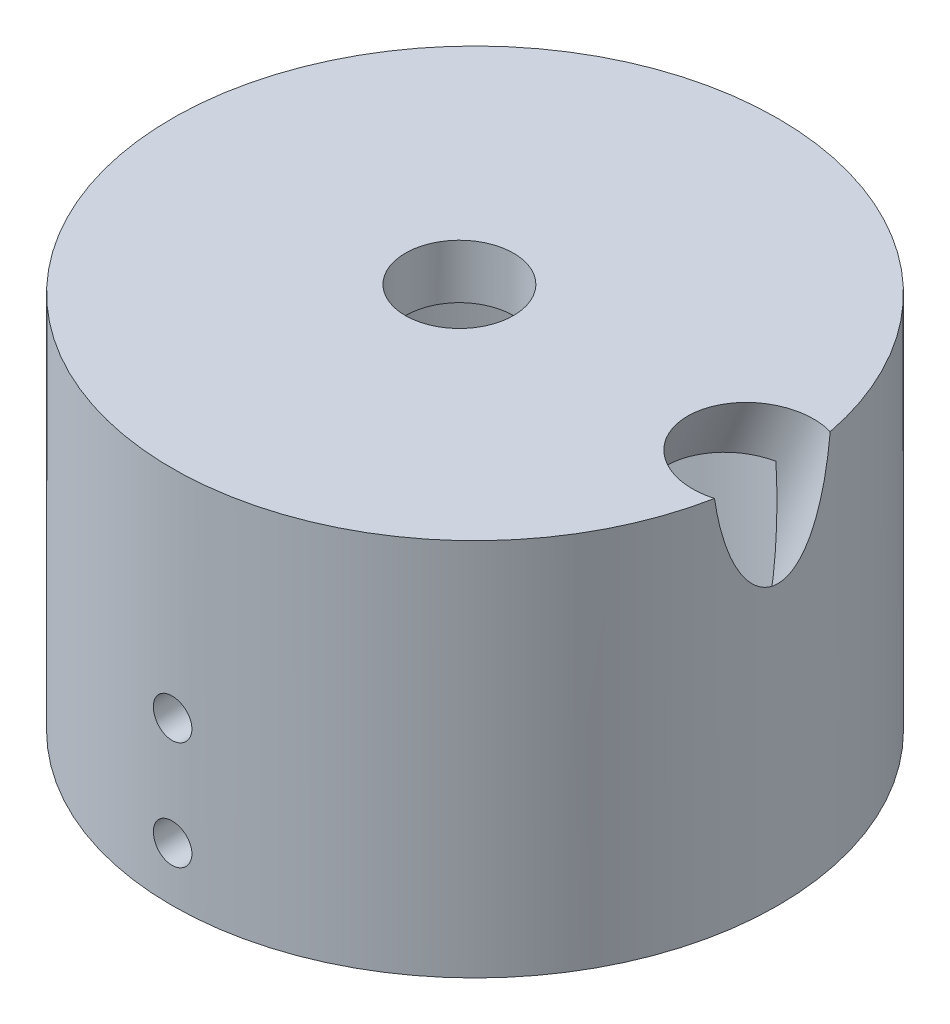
ISO-10303-21;
HEADER;
FILE_DESCRIPTION(('STEP AP214'),'2;1');
FILE_NAME('part.step','',(''),(''),'','','');
FILE_SCHEMA(('AUTOMOTIVE_DESIGN { 1 0 10303 214 1 1 1 1 }'));
ENDSEC;
DATA;
#1=APPLICATION_CONTEXT('core data for automotive mechanical design processes');
#2=APPLICATION_PROTOCOL_DEFINITION('international standard','automotive_design',2000,#1);
#3=PRODUCT_CONTEXT('',#1,'mechanical');
#4=PRODUCT('Part','Part','',(#3));
#5=PRODUCT_RELATED_PRODUCT_CATEGORY('part','',(#4));
#6=PRODUCT_DEFINITION_FORMATION('','',#4);
#7=PRODUCT_DEFINITION_CONTEXT('part definition',#1,'design');
#8=PRODUCT_DEFINITION('design','',#6,#7);
#9=PRODUCT_DEFINITION_SHAPE('','',#8);
#10=(LENGTH_UNIT() NAMED_UNIT(*) SI_UNIT(.MILLI.,.METRE.));
#11=(NAMED_UNIT(*) PLANE_ANGLE_UNIT() SI_UNIT($,.RADIAN.));
#12=(NAMED_UNIT(*) SI_UNIT($,.STERADIAN.) SOLID_ANGLE_UNIT());
#13=UNCERTAINTY_MEASURE_WITH_UNIT(LENGTH_MEASURE(1.E-05),#10,'distance_accuracy_value','');
#14=(GEOMETRIC_REPRESENTATION_CONTEXT(3) GLOBAL_UNCERTAINTY_ASSIGNED_CONTEXT((#13)) GLOBAL_UNIT_ASSIGNED_CONTEXT((#10,
#11,#12)) REPRESENTATION_CONTEXT('',''));
#15=CARTESIAN_POINT('',(0.,0.,0.));
#16=DIRECTION('',(0.,0.,1.));
#17=DIRECTION('',(1.,0.,0.));
#18=AXIS2_PLACEMENT_3D('',#15,#16,#17);
#19=CARTESIAN_POINT('',(0.,0.,0.));
#20=DIRECTION('',(0.,-1.,0.));
#21=DIRECTION('',(0.,0.,-1.));
#22=AXIS2_PLACEMENT_3D('',#19,#20,#21);
#23=CYLINDRICAL_SURFACE('',#22,14.605);
#24=CARTESIAN_POINT('',(-1.1303,3.175,14.5611966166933));
#25=CARTESIAN_POINT('',(-1.13029722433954,3.11161263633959,14.5611971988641));
#26=CARTESIAN_POINT('',(-1.12494991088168,3.04818173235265,14.5616149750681));
#27=CARTESIAN_POINT('',(-1.10369654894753,2.9230738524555,14.5632409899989));
#28=CARTESIAN_POINT('',(-1.0877784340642,2.86139896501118,14.5644501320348));
#29=CARTESIAN_POINT('',(-1.04584560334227,2.74163327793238,14.5675211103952));
#30=CARTESIAN_POINT('',(-1.01983648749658,2.68354051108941,14.5693825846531));
#31=CARTESIAN_POINT('',(-0.958469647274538,2.57255949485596,14.5735480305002));
#32=CARTESIAN_POINT('',(-0.92311396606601,2.51967011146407,14.5758519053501));
#33=CARTESIAN_POINT('',(-0.843972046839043,2.4204648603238,14.5806483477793));
#34=CARTESIAN_POINT('',(-0.800169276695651,2.37416219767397,14.5831412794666));
#35=CARTESIAN_POINT('',(-0.705411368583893,2.28955808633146,14.5880315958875));
#36=CARTESIAN_POINT('',(-0.654455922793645,2.2512569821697,14.5904289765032));
#37=CARTESIAN_POINT('',(-0.546761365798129,2.18370009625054,14.5948614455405));
#38=CARTESIAN_POINT('',(-0.4900151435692,2.15445561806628,14.5968960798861));
#39=CARTESIAN_POINT('',(-0.372399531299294,2.10591444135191,14.6003699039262));
#40=CARTESIAN_POINT('',(-0.311530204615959,2.08661759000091,14.6018091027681));
#41=CARTESIAN_POINT('',(-0.187526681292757,2.0585571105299,14.6039273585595));
#42=CARTESIAN_POINT('',(-0.124397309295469,2.04977227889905,14.604607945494));
#43=CARTESIAN_POINT('',(0.00244333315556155,2.04291968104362,14.605137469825));
#44=CARTESIAN_POINT('',(0.0661545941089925,2.04485174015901,14.6049864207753));
#45=CARTESIAN_POINT('',(0.192206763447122,2.05936069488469,14.6038709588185));
#46=CARTESIAN_POINT('',(0.254550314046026,2.07191478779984,14.6029082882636));
#47=CARTESIAN_POINT('',(0.376242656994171,2.1072760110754,14.6002798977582));
#48=CARTESIAN_POINT('',(0.435591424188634,2.1300832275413,14.5986141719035));
#49=CARTESIAN_POINT('',(0.549682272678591,2.18532882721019,14.5947641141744));
#50=CARTESIAN_POINT('',(0.604419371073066,2.21777746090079,14.592579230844));
#51=CARTESIAN_POINT('',(0.707678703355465,2.29137735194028,14.5879365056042));
#52=CARTESIAN_POINT('',(0.756200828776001,2.33252876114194,14.5854786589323));
#53=CARTESIAN_POINT('',(0.845786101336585,2.42249466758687,14.5805587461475));
#54=CARTESIAN_POINT('',(0.886829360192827,2.47132897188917,14.5780966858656));
#55=CARTESIAN_POINT('',(0.960138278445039,2.5752053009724,14.5734523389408));
#56=CARTESIAN_POINT('',(0.992403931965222,2.6302473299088,14.5712700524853));
#57=CARTESIAN_POINT('',(1.04724077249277,2.74499021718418,14.5674318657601));
#58=CARTESIAN_POINT('',(1.06981098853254,2.80469154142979,14.5657760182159));
#59=CARTESIAN_POINT('',(1.10460185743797,2.92705192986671,14.5631791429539));
#60=CARTESIAN_POINT('',(1.11682269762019,2.98971094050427,14.5622381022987));
#61=CARTESIAN_POINT('',(1.13054285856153,3.11603418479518,14.5611794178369));
#62=CARTESIAN_POINT('',(1.13206988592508,3.17969539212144,14.5610596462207));
#63=CARTESIAN_POINT('',(1.12443159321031,3.30636869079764,14.5616514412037));
#64=CARTESIAN_POINT('',(1.11526635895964,3.36938078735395,14.5623630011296));
#65=CARTESIAN_POINT('',(1.08652678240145,3.49288801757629,14.5645353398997));
#66=CARTESIAN_POINT('',(1.06696531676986,3.55338616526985,14.565995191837));
#67=CARTESIAN_POINT('',(1.01800163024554,3.67024143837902,14.5694988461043));
#68=CARTESIAN_POINT('',(0.988599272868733,3.72659850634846,14.5715426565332));
#69=CARTESIAN_POINT('',(0.920718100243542,3.83369879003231,14.5759890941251));
#70=CARTESIAN_POINT('',(0.882220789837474,3.88443025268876,14.5783924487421));
#71=CARTESIAN_POINT('',(0.797269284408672,3.97872058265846,14.5832846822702));
#72=CARTESIAN_POINT('',(0.750814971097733,4.02227934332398,14.5857735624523));
#73=CARTESIAN_POINT('',(0.651148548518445,4.10108206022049,14.5905627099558));
#74=CARTESIAN_POINT('',(0.597922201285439,4.13630803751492,14.592862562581));
#75=CARTESIAN_POINT('',(0.486293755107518,4.1973219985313,14.5970085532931));
#76=CARTESIAN_POINT('',(0.427891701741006,4.22311006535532,14.5988546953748));
#77=CARTESIAN_POINT('',(0.307634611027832,4.26448517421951,14.601883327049));
#78=CARTESIAN_POINT('',(0.245783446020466,4.28008341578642,14.6030665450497));
#79=CARTESIAN_POINT('',(0.120330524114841,4.30067271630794,14.6046389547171));
#80=CARTESIAN_POINT('',(0.0567287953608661,4.30566394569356,14.6050281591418));
#81=CARTESIAN_POINT('',(-0.070242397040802,4.30489566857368,14.6049687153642));
#82=CARTESIAN_POINT('',(-0.133612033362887,4.29916421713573,14.6045222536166));
#83=CARTESIAN_POINT('',(-0.258485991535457,4.2771716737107,14.6028459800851));
#84=CARTESIAN_POINT('',(-0.319990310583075,4.26091056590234,14.6016161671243));
#85=CARTESIAN_POINT('',(-0.439390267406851,4.21832720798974,14.5985112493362));
#86=CARTESIAN_POINT('',(-0.497286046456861,4.19200535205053,14.5966361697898));
#87=CARTESIAN_POINT('',(-0.607841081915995,4.13005103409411,14.592450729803));
#88=CARTESIAN_POINT('',(-0.660500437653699,4.09441874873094,14.5901403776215));
#89=CARTESIAN_POINT('',(-0.759231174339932,4.01474995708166,14.5853366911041));
#90=CARTESIAN_POINT('',(-0.805285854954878,3.97069278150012,14.5828429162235));
#91=CARTESIAN_POINT('',(-0.889364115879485,3.87546023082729,14.5779571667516));
#92=CARTESIAN_POINT('',(-0.927385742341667,3.82428312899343,14.5755652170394));
#93=CARTESIAN_POINT('',(-0.994362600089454,3.71617715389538,14.5711495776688));
#94=CARTESIAN_POINT('',(-1.02330257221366,3.65923881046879,14.5691265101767));
#95=CARTESIAN_POINT('',(-1.07117500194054,3.54133515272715,14.5656853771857));
#96=CARTESIAN_POINT('',(-1.09011903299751,3.48037458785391,14.5642666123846));
#97=CARTESIAN_POINT('',(-1.11260579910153,3.37837507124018,14.5625617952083));
#98=CARTESIAN_POINT('',(-1.11923238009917,3.3379932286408,14.5620521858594));
#99=CARTESIAN_POINT('',(-1.12808037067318,3.2567469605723,14.5613694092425));
#100=CARTESIAN_POINT('',(-1.1303017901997,3.21588253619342,14.5611962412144));
#101=CARTESIAN_POINT('',(-1.1303,3.175,14.5611966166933));
#102=B_SPLINE_CURVE_WITH_KNOTS('',3,(#24,#25,#26,#27,#28,#29,#30,#31,#32,#33,#34,#35,#36,#37,
#38,#39,#40,#41,#42,#43,#44,#45,#46,#47,#48,#49,#50,#51,#52,#53,#54,#55,#56,#57,#58,#59,#60,#61,
#62,#63,#64,#65,#66,#67,#68,#69,#70,#71,#72,#73,#74,#75,#76,#77,#78,#79,#80,#81,#82,#83,#84,#85,
#86,#87,#88,#89,#90,#91,#92,#93,#94,#95,#96,#97,#98,#99,#100,#101),.UNSPECIFIED.,.T.,.F.,(4,2,2,
2,2,2,2,2,2,2,2,2,2,2,2,2,2,2,2,2,2,2,2,2,2,2,2,2,2,2,2,2,2,2,2,2,2,2,4),(0.,0.190012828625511,
0.380242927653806,0.570367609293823,0.760450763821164,0.950909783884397,1.14137700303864,
1.33208099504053,1.522782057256,1.71309780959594,1.90341046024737,2.0933155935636,
2.28322232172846,2.47333168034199,2.66344435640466,2.85405544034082,3.044666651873,
3.23529694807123,3.42592379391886,3.61605656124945,3.80618780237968,3.99608409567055,
4.18598302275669,4.37627149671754,4.56656279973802,4.75726100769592,4.94795753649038,
5.13844411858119,5.32892763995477,5.5189134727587,5.70889959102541,5.89887826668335,
6.08885333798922,6.2793006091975,6.46979414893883,6.6606060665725,6.85119657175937,
6.97374818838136,7.09629952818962),.UNSPECIFIED.);
#103=CARTESIAN_POINT('',(-1.1303,3.175,14.5611966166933));
#104=VERTEX_POINT('',#103);
#105=EDGE_CURVE('E73',#104,#104,#102,.T.);
#106=ORIENTED_EDGE('',*,*,#105,.T.);
#107=EDGE_LOOP('',(#106));
#108=FACE_BOUND('',#107,.T.);
#109=CARTESIAN_POINT('',(0.,0.,0.));
#110=DIRECTION('',(0.,-1.,0.));
#111=DIRECTION('',(0.,0.,-1.));
#112=AXIS2_PLACEMENT_3D('',#109,#110,#111);
#113=CIRCLE('',#112,14.605);
#114=CARTESIAN_POINT('',(0.,0.,-14.605));
#115=VERTEX_POINT('',#114);
#116=EDGE_CURVE('E80',#115,#115,#113,.T.);
#117=ORIENTED_EDGE('',*,*,#116,.T.);
#118=EDGE_LOOP('',(#117));
#119=FACE_BOUND('',#118,.T.);
#120=CARTESIAN_POINT('',(0.,19.05,0.));
#121=DIRECTION('',(0.,-1.,0.));
#122=DIRECTION('',(0.,0.,-1.));
#123=AXIS2_PLACEMENT_3D('',#120,#121,#122);
#124=CIRCLE('',#123,14.605);
#125=CARTESIAN_POINT('',(14.1869840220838,19.05,3.46922316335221));
#126=VERTEX_POINT('',#125);
#127=CARTESIAN_POINT('',(14.1869840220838,19.05,-3.46922316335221));
#128=VERTEX_POINT('',#127);
#129=EDGE_CURVE('E66',#126,#128,#124,.T.);
#130=ORIENTED_EDGE('',*,*,#129,.F.);
#131=CARTESIAN_POINT('',(14.1869840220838,19.05,3.46922316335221));
#132=CARTESIAN_POINT('',(14.1812130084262,18.7557643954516,3.49278086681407));
#133=CARTESIAN_POINT('',(14.1765358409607,18.4611225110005,3.51169291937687));
#134=CARTESIAN_POINT('',(14.1695344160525,17.8712678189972,3.53986017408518));
#135=CARTESIAN_POINT('',(14.1672108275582,17.5760548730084,3.54911263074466));
#136=CARTESIAN_POINT('',(14.1650750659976,16.9826385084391,3.55762189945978));
#137=CARTESIAN_POINT('',(14.1652871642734,16.68443353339,3.55678210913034));
#138=CARTESIAN_POINT('',(14.1684555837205,16.0882909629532,3.5441419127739));
#139=CARTESIAN_POINT('',(14.1714116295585,15.7903533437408,3.5323426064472));
#140=CARTESIAN_POINT('',(14.1803795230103,15.1857712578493,3.49617355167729));
#141=CARTESIAN_POINT('',(14.1864853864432,14.8791505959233,3.47141669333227));
#142=CARTESIAN_POINT('',(14.2019738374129,14.2675188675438,3.40749913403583));
#143=CARTESIAN_POINT('',(14.21135596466,13.9625075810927,3.3683404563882));
#144=CARTESIAN_POINT('',(14.2334984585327,13.3562698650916,3.27352347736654));
#145=CARTESIAN_POINT('',(14.2462460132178,13.0550335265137,3.21792765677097));
#146=CARTESIAN_POINT('',(14.2679458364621,12.6066486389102,3.11974952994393));
#147=CARTESIAN_POINT('',(14.275606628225,12.4578019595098,3.08457003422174));
#148=CARTESIAN_POINT('',(14.2917799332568,12.1615578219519,3.0087480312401));
#149=CARTESIAN_POINT('',(14.3002923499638,12.0141602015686,2.96810614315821));
#150=CARTESIAN_POINT('',(14.3175143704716,11.7316161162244,2.88383788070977));
#151=CARTESIAN_POINT('',(14.3261671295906,11.5963424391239,2.84062786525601));
#152=CARTESIAN_POINT('',(14.3441573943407,11.3278144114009,2.7483426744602));
#153=CARTESIAN_POINT('',(14.3534950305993,11.1945604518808,2.69926637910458));
#154=CARTESIAN_POINT('',(14.37278427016,10.9308552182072,2.594595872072));
#155=CARTESIAN_POINT('',(14.3827351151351,10.8004007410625,2.53900963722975));
#156=CARTESIAN_POINT('',(14.403168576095,10.5429526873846,2.42041056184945));
#157=CARTESIAN_POINT('',(14.4136510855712,10.41595842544,2.35739920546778));
#158=CARTESIAN_POINT('',(14.4329924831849,10.1900606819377,2.23557610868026));
#159=CARTESIAN_POINT('',(14.441785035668,10.0903738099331,2.178211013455));
#160=CARTESIAN_POINT('',(14.4595113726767,9.89487607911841,2.05725424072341));
#161=CARTESIAN_POINT('',(14.4684451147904,9.79906408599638,1.99366440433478));
#162=CARTESIAN_POINT('',(14.4862788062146,9.61261145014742,1.85965399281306));
#163=CARTESIAN_POINT('',(14.4951787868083,9.52196005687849,1.78924850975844));
#164=CARTESIAN_POINT('',(14.5127352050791,9.3472051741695,1.64076983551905));
#165=CARTESIAN_POINT('',(14.5213918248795,9.26309670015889,1.56270258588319));
#166=CARTESIAN_POINT('',(14.5390532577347,9.09493934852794,1.38936627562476));
#167=CARTESIAN_POINT('',(14.54799756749,9.01184358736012,1.29315092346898));
#168=CARTESIAN_POINT('',(14.5646398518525,8.8600219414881,1.08979736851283));
#169=CARTESIAN_POINT('',(14.5723390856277,8.79128151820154,0.982670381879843));
#170=CARTESIAN_POINT('',(14.58466563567,8.6826478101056,0.776168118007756));
#171=CARTESIAN_POINT('',(14.5895883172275,8.63988789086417,0.678337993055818));
#172=CARTESIAN_POINT('',(14.5975597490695,8.57111011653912,0.476862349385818));
#173=CARTESIAN_POINT('',(14.6006103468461,8.54507575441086,0.373222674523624));
#174=CARTESIAN_POINT('',(14.6044824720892,8.51208874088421,0.162177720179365));
#175=CARTESIAN_POINT('',(14.6052901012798,8.50525506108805,0.0547531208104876));
#176=CARTESIAN_POINT('',(14.6045221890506,8.51177500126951,-0.159471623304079));
#177=CARTESIAN_POINT('',(14.6029464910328,8.52512994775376,-0.266271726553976));
#178=CARTESIAN_POINT('',(14.5978826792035,8.56840724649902,-0.465689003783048));
#179=CARTESIAN_POINT('',(14.5945901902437,8.59663754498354,-0.558690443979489));
#180=CARTESIAN_POINT('',(14.5865485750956,8.66631902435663,-0.739477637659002));
#181=CARTESIAN_POINT('',(14.5817988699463,8.7077754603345,-0.827261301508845));
#182=CARTESIAN_POINT('',(14.5683208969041,8.82701096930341,-1.04269957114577));
#183=CARTESIAN_POINT('',(14.5588322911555,8.91229297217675,-1.16614113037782));
#184=CARTESIAN_POINT('',(14.5383938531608,9.10101824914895,-1.39813872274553));
#185=CARTESIAN_POINT('',(14.5274400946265,9.20451056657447,-1.50665311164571));
#186=CARTESIAN_POINT('',(14.5066885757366,9.40668805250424,-1.69393169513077));
#187=CARTESIAN_POINT('',(14.4969798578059,9.50357047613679,-1.77469088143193));
#188=CARTESIAN_POINT('',(14.4774497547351,9.703992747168,-1.9275420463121));
#189=CARTESIAN_POINT('',(14.4676282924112,9.80753741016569,-1.99962764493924));
#190=CARTESIAN_POINT('',(14.4481005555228,10.0197220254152,-2.13615827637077));
#191=CARTESIAN_POINT('',(14.4383944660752,10.1283690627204,-2.20059221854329));
#192=CARTESIAN_POINT('',(14.419267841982,10.3494924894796,-2.32261749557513));
#193=CARTESIAN_POINT('',(14.4098474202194,10.4619703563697,-2.38020615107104));
#194=CARTESIAN_POINT('',(14.3912799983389,10.6914149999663,-2.49002587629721));
#195=CARTESIAN_POINT('',(14.3821384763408,10.8084220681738,-2.54217320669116));
#196=CARTESIAN_POINT('',(14.3643404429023,11.0448161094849,-2.64088088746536));
#197=CARTESIAN_POINT('',(14.3556840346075,11.1642035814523,-2.68744005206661));
#198=CARTESIAN_POINT('',(14.3305125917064,11.5253373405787,-2.81967505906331));
#199=CARTESIAN_POINT('',(14.3148075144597,11.7699050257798,-2.89783887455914));
#200=CARTESIAN_POINT('',(14.2857016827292,12.2650225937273,-3.03806654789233));
#201=CARTESIAN_POINT('',(14.2723135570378,12.5155972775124,-3.10004305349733));
#202=CARTESIAN_POINT('',(14.2479923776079,13.0197863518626,-3.20996878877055));
#203=CARTESIAN_POINT('',(14.2370583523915,13.2733994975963,-3.25792357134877));
#204=CARTESIAN_POINT('',(14.2185282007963,13.7585908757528,-3.33781096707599));
#205=CARTESIAN_POINT('',(14.2107142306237,13.9899854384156,-3.37082973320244));
#206=CARTESIAN_POINT('',(14.1970128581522,14.4539350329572,-3.42807765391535));
#207=CARTESIAN_POINT('',(14.1911256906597,14.6864902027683,-3.45230573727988));
#208=CARTESIAN_POINT('',(14.1812045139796,15.1525387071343,-3.4928349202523));
#209=CARTESIAN_POINT('',(14.1771722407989,15.3860327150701,-3.50912859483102));
#210=CARTESIAN_POINT('',(14.1708896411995,15.8534413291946,-3.53441366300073));
#211=CARTESIAN_POINT('',(14.1686393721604,16.0873559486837,-3.54340482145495));
#212=CARTESIAN_POINT('',(14.1658750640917,16.5491554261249,-3.55443934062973));
#213=CARTESIAN_POINT('',(14.1653166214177,16.777035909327,-3.55666039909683));
#214=CARTESIAN_POINT('',(14.1657323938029,17.232775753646,-3.55500337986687));
#215=CARTESIAN_POINT('',(14.1667066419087,17.4606351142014,-3.5511251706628));
#216=CARTESIAN_POINT('',(14.170106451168,17.9156270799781,-3.53753645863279));
#217=CARTESIAN_POINT('',(14.1725285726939,18.1427601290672,-3.52783977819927));
#218=CARTESIAN_POINT('',(14.1787456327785,18.5966750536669,-3.50276126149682));
#219=CARTESIAN_POINT('',(14.1825404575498,18.8234569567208,-3.48737989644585));
#220=CARTESIAN_POINT('',(14.1869840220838,19.05,-3.46922316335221));
#221=B_SPLINE_CURVE_WITH_KNOTS('',3,(#131,#132,#133,#134,#135,#136,#137,#138,#139,#140,#141,
#142,#143,#144,#145,#146,#147,#148,#149,#150,#151,#152,#153,#154,#155,#156,#157,#158,#159,#160,
#161,#162,#163,#164,#165,#166,#167,#168,#169,#170,#171,#172,#173,#174,#175,#176,#177,#178,#179,
#180,#181,#182,#183,#184,#185,#186,#187,#188,#189,#190,#191,#192,#193,#194,#195,#196,#197,#198,
#199,#200,#201,#202,#203,#204,#205,#206,#207,#208,#209,#210,#211,#212,#213,#214,#215,#216,#217,
#218,#219,#220),.UNSPECIFIED.,.F.,.F.,(4,2,2,2,2,2,2,2,2,2,2,2,2,2,2,2,2,2,2,2,2,2,2,2,2,2,2,2,
2,2,2,2,2,2,2,2,2,2,2,2,2,2,2,2,4),(0.,0.885680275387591,1.77161221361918,2.66603094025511,
3.56035992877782,4.48307575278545,5.40566199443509,6.32478543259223,6.78411815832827,
7.24339886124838,7.67009242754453,8.09686759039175,8.52312517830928,8.94929770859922,
9.29515115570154,9.64090261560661,9.98590525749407,10.330642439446,10.7119555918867,
11.0928806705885,11.4122446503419,11.7312929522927,12.0523138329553,12.3733558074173,
12.663938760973,12.9546373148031,13.4030805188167,13.8527504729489,14.2317170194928,
14.6109606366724,14.9907474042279,15.3706823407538,15.755796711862,16.1409926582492,
16.9118800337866,17.6868452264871,18.4615030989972,19.1629217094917,19.8644257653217,
20.5665850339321,21.2687669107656,21.9523523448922,22.6359525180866,23.3179351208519,
23.9998612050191),.UNSPECIFIED.);
#222=EDGE_CURVE('E72',#126,#128,#221,.T.);
#223=ORIENTED_EDGE('',*,*,#222,.T.);
#224=EDGE_LOOP('',(#130,#223));
#225=FACE_BOUND('',#224,.T.);
#226=CARTESIAN_POINT('',(-1.1303,9.525,14.5611966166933));
#227=CARTESIAN_POINT('',(-1.13029722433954,9.46161263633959,14.5611971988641));
#228=CARTESIAN_POINT('',(-1.12494991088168,9.39818173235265,14.5616149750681));
#229=CARTESIAN_POINT('',(-1.10369654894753,9.27307385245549,14.5632409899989));
#230=CARTESIAN_POINT('',(-1.0877784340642,9.21139896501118,14.5644501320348));
#231=CARTESIAN_POINT('',(-1.04584560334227,9.09163327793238,14.5675211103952));
#232=CARTESIAN_POINT('',(-1.01983648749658,9.0335405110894,14.5693825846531));
#233=CARTESIAN_POINT('',(-0.958469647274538,8.92255949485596,14.5735480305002));
#234=CARTESIAN_POINT('',(-0.92311396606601,8.86967011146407,14.5758519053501));
#235=CARTESIAN_POINT('',(-0.843972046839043,8.77046486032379,14.5806483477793));
#236=CARTESIAN_POINT('',(-0.80016927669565,8.72416219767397,14.5831412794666));
#237=CARTESIAN_POINT('',(-0.705411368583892,8.63955808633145,14.5880315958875));
#238=CARTESIAN_POINT('',(-0.654455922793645,8.6012569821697,14.5904289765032));
#239=CARTESIAN_POINT('',(-0.546761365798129,8.53370009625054,14.5948614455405));
#240=CARTESIAN_POINT('',(-0.490015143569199,8.50445561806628,14.5968960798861));
#241=CARTESIAN_POINT('',(-0.372399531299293,8.45591444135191,14.6003699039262));
#242=CARTESIAN_POINT('',(-0.311530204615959,8.43661759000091,14.6018091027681));
#243=CARTESIAN_POINT('',(-0.187526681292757,8.4085571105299,14.6039273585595));
#244=CARTESIAN_POINT('',(-0.124397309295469,8.39977227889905,14.604607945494));
#245=CARTESIAN_POINT('',(0.00244333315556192,8.39291968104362,14.605137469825));
#246=CARTESIAN_POINT('',(0.0661545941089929,8.39485174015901,14.6049864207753));
#247=CARTESIAN_POINT('',(0.192206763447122,8.40936069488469,14.6038709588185));
#248=CARTESIAN_POINT('',(0.254550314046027,8.42191478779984,14.6029082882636));
#249=CARTESIAN_POINT('',(0.376242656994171,8.4572760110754,14.6002798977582));
#250=CARTESIAN_POINT('',(0.435591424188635,8.4800832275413,14.5986141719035));
#251=CARTESIAN_POINT('',(0.549682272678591,8.53532882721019,14.5947641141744));
#252=CARTESIAN_POINT('',(0.604419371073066,8.56777746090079,14.592579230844));
#253=CARTESIAN_POINT('',(0.707678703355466,8.64137735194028,14.5879365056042));
#254=CARTESIAN_POINT('',(0.756200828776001,8.68252876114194,14.5854786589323));
#255=CARTESIAN_POINT('',(0.845786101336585,8.77249466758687,14.5805587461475));
#256=CARTESIAN_POINT('',(0.886829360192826,8.82132897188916,14.5780966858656));
#257=CARTESIAN_POINT('',(0.960138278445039,8.9252053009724,14.5734523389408));
#258=CARTESIAN_POINT('',(0.992403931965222,8.9802473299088,14.5712700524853));
#259=CARTESIAN_POINT('',(1.04724077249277,9.09499021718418,14.5674318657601));
#260=CARTESIAN_POINT('',(1.06981098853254,9.15469154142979,14.5657760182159));
#261=CARTESIAN_POINT('',(1.10460185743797,9.27705192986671,14.5631791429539));
#262=CARTESIAN_POINT('',(1.11682269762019,9.33971094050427,14.5622381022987));
#263=CARTESIAN_POINT('',(1.13054285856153,9.46603418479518,14.5611794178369));
#264=CARTESIAN_POINT('',(1.13206988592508,9.52969539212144,14.5610596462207));
#265=CARTESIAN_POINT('',(1.12443159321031,9.65636869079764,14.5616514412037));
#266=CARTESIAN_POINT('',(1.11526635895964,9.71938078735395,14.5623630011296));
#267=CARTESIAN_POINT('',(1.08652678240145,9.84288801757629,14.5645353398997));
#268=CARTESIAN_POINT('',(1.06696531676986,9.90338616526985,14.565995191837));
#269=CARTESIAN_POINT('',(1.01800163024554,10.020241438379,14.5694988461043));
#270=CARTESIAN_POINT('',(0.988599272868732,10.0765985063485,14.5715426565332));
#271=CARTESIAN_POINT('',(0.920718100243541,10.1836987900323,14.5759890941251));
#272=CARTESIAN_POINT('',(0.882220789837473,10.2344302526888,14.5783924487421));
#273=CARTESIAN_POINT('',(0.79726928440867,10.3287205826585,14.5832846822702));
#274=CARTESIAN_POINT('',(0.750814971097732,10.372279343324,14.5857735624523));
#275=CARTESIAN_POINT('',(0.651148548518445,10.4510820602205,14.5905627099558));
#276=CARTESIAN_POINT('',(0.597922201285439,10.4863080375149,14.592862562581));
#277=CARTESIAN_POINT('',(0.486293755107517,10.5473219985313,14.5970085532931));
#278=CARTESIAN_POINT('',(0.427891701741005,10.5731100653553,14.5988546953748));
#279=CARTESIAN_POINT('',(0.307634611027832,10.6144851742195,14.601883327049));
#280=CARTESIAN_POINT('',(0.245783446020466,10.6300834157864,14.6030665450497));
#281=CARTESIAN_POINT('',(0.120330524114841,10.6506727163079,14.6046389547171));
#282=CARTESIAN_POINT('',(0.0567287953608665,10.6556639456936,14.6050281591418));
#283=CARTESIAN_POINT('',(-0.0702423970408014,10.6548956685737,14.6049687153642));
#284=CARTESIAN_POINT('',(-0.133612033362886,10.6491642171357,14.6045222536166));
#285=CARTESIAN_POINT('',(-0.258485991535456,10.6271716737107,14.6028459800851));
#286=CARTESIAN_POINT('',(-0.319990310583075,10.6109105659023,14.6016161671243));
#287=CARTESIAN_POINT('',(-0.439390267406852,10.5683272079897,14.5985112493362));
#288=CARTESIAN_POINT('',(-0.497286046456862,10.5420053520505,14.5966361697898));
#289=CARTESIAN_POINT('',(-0.607841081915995,10.4800510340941,14.592450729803));
#290=CARTESIAN_POINT('',(-0.6605004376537,10.4444187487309,14.5901403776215));
#291=CARTESIAN_POINT('',(-0.759231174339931,10.3647499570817,14.5853366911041));
#292=CARTESIAN_POINT('',(-0.805285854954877,10.3206927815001,14.5828429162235));
#293=CARTESIAN_POINT('',(-0.889364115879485,10.2254602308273,14.5779571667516));
#294=CARTESIAN_POINT('',(-0.927385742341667,10.1742831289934,14.5755652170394));
#295=CARTESIAN_POINT('',(-0.994362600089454,10.0661771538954,14.5711495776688));
#296=CARTESIAN_POINT('',(-1.02330257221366,10.0092388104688,14.5691265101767));
#297=CARTESIAN_POINT('',(-1.07117500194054,9.89133515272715,14.5656853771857));
#298=CARTESIAN_POINT('',(-1.09011903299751,9.83037458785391,14.5642666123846));
#299=CARTESIAN_POINT('',(-1.11260579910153,9.72837507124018,14.5625617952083));
#300=CARTESIAN_POINT('',(-1.11923238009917,9.6879932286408,14.5620521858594));
#301=CARTESIAN_POINT('',(-1.12808037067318,9.6067469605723,14.5613694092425));
#302=CARTESIAN_POINT('',(-1.1303017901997,9.56588253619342,14.5611962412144));
#303=CARTESIAN_POINT('',(-1.1303,9.525,14.5611966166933));
#304=B_SPLINE_CURVE_WITH_KNOTS('',3,(#226,#227,#228,#229,#230,#231,#232,#233,#234,#235,#236,
#237,#238,#239,#240,#241,#242,#243,#244,#245,#246,#247,#248,#249,#250,#251,#252,#253,#254,#255,
#256,#257,#258,#259,#260,#261,#262,#263,#264,#265,#266,#267,#268,#269,#270,#271,#272,#273,#274,
#275,#276,#277,#278,#279,#280,#281,#282,#283,#284,#285,#286,#287,#288,#289,#290,#291,#292,#293,
#294,#295,#296,#297,#298,#299,#300,#301,#302,#303),.UNSPECIFIED.,.T.,.F.,(4,2,2,2,2,2,2,2,2,2,2,
2,2,2,2,2,2,2,2,2,2,2,2,2,2,2,2,2,2,2,2,2,2,2,2,2,2,2,4),(0.,0.190012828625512,
0.380242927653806,0.570367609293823,0.760450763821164,0.950909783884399,1.14137700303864,
1.33208099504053,1.522782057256,1.71309780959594,1.90341046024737,2.0933155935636,
2.28322232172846,2.47333168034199,2.66344435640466,2.85405544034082,3.044666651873,
3.23529694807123,3.42592379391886,3.61605656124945,3.80618780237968,3.99608409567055,
4.18598302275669,4.37627149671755,4.56656279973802,4.75726100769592,4.94795753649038,
5.13844411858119,5.32892763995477,5.5189134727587,5.7088995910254,5.89887826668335,
6.08885333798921,6.27930060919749,6.46979414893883,6.66060606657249,6.85119657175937,
6.97374818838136,7.09629952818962),.UNSPECIFIED.);
#305=CARTESIAN_POINT('',(-1.1303,9.525,14.5611966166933));
#306=VERTEX_POINT('',#305);
#307=EDGE_CURVE('E112',#306,#306,#304,.T.);
#308=ORIENTED_EDGE('',*,*,#307,.T.);
#309=EDGE_LOOP('',(#308));
#310=FACE_BOUND('',#309,.T.);
#311=ADVANCED_FACE('F31',(#108,#119,#225,#310),#23,.F.);
#312=CARTESIAN_POINT('',(0.,0.,0.));
#313=DIRECTION('',(0.,-1.,0.));
#314=DIRECTION('',(0.,0.,-1.));
#315=AXIS2_PLACEMENT_3D('',#312,#313,#314);
#316=CYLINDRICAL_SURFACE('',#315,17.78);
#317=CARTESIAN_POINT('',(0.,0.,0.));
#318=DIRECTION('',(0.,-1.,0.));
#319=DIRECTION('',(0.,0.,-1.));
#320=AXIS2_PLACEMENT_3D('',#317,#318,#319);
#321=CIRCLE('',#320,17.78);
#322=CARTESIAN_POINT('',(0.,0.,-17.78));
#323=VERTEX_POINT('',#322);
#324=EDGE_CURVE('E76',#323,#323,#321,.T.);
#325=ORIENTED_EDGE('',*,*,#324,.F.);
#326=EDGE_LOOP('',(#325));
#327=FACE_BOUND('',#326,.T.);
#328=CARTESIAN_POINT('',(0.,22.225,0.));
#329=DIRECTION('',(0.,-1.,0.));
#330=DIRECTION('',(0.,0.,-1.));
#331=AXIS2_PLACEMENT_3D('',#328,#329,#330);
#332=CIRCLE('',#331,17.78);
#333=CARTESIAN_POINT('',(17.4528632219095,22.225,3.3949912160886));
#334=VERTEX_POINT('',#333);
#335=CARTESIAN_POINT('',(17.4528632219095,22.225,-3.3949912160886));
#336=VERTEX_POINT('',#335);
#337=EDGE_CURVE('E71',#334,#336,#332,.T.);
#338=ORIENTED_EDGE('',*,*,#337,.T.);
#339=CARTESIAN_POINT('',(17.4528632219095,22.225,-3.3949912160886));
#340=CARTESIAN_POINT('',(17.4563597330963,22.0796539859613,-3.37700677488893));
#341=CARTESIAN_POINT('',(17.4601539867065,21.9345132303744,-3.35736221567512));
#342=CARTESIAN_POINT('',(17.4683441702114,21.6447531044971,-3.3144903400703));
#343=CARTESIAN_POINT('',(17.4727402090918,21.5001338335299,-3.29126237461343));
#344=CARTESIAN_POINT('',(17.4821587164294,21.210971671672,-3.24086140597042));
#345=CARTESIAN_POINT('',(17.4871837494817,21.0664316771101,-3.21367217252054));
#346=CARTESIAN_POINT('',(17.4978462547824,20.7782308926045,-3.1551013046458));
#347=CARTESIAN_POINT('',(17.5034836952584,20.6345700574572,-3.12371988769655));
#348=CARTESIAN_POINT('',(17.5155943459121,20.3428736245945,-3.05509674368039));
#349=CARTESIAN_POINT('',(17.5220912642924,20.1948806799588,-3.01767687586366));
#350=CARTESIAN_POINT('',(17.5357277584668,19.9004090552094,-2.93739872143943));
#351=CARTESIAN_POINT('',(17.5428672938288,19.7539302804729,-2.8945407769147));
#352=CARTESIAN_POINT('',(17.5577518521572,19.4631433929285,-2.80283893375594));
#353=CARTESIAN_POINT('',(17.5654958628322,19.3188321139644,-2.75400496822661));
#354=CARTESIAN_POINT('',(17.5815549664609,19.0327386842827,-2.64955108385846));
#355=CARTESIAN_POINT('',(17.5898699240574,18.890955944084,-2.59393277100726));
#356=CARTESIAN_POINT('',(17.6064128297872,18.6203308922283,-2.47906411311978));
#357=CARTESIAN_POINT('',(17.6146073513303,18.4912697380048,-2.42032749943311));
#358=CARTESIAN_POINT('',(17.6313487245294,18.2368431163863,-2.29519795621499));
#359=CARTESIAN_POINT('',(17.6398957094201,18.1114790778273,-2.22880211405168));
#360=CARTESIAN_POINT('',(17.6571358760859,17.8667731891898,-2.08781247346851));
#361=CARTESIAN_POINT('',(17.6658273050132,17.7473906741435,-2.01328969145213));
#362=CARTESIAN_POINT('',(17.6832183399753,17.5154808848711,-1.85434162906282));
#363=CARTESIAN_POINT('',(17.6919179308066,17.4029473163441,-1.76992565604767));
#364=CARTESIAN_POINT('',(17.7086041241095,17.1926920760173,-1.59409843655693));
#365=CARTESIAN_POINT('',(17.7166046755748,17.0945122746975,-1.50324314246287));
#366=CARTESIAN_POINT('',(17.7319559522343,16.9101188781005,-1.30978892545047));
#367=CARTESIAN_POINT('',(17.7393066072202,16.8239065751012,-1.20718873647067));
#368=CARTESIAN_POINT('',(17.7518031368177,16.6797969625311,-1.00527189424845));
#369=CARTESIAN_POINT('',(17.7571141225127,16.6196081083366,-0.907624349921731));
#370=CARTESIAN_POINT('',(17.7663585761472,16.51593293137,-0.703737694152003));
#371=CARTESIAN_POINT('',(17.7702943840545,16.4724182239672,-0.597513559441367));
#372=CARTESIAN_POINT('',(17.7757674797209,16.4122412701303,-0.398211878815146));
#373=CARTESIAN_POINT('',(17.7776078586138,16.39216824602,-0.306181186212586));
#374=CARTESIAN_POINT('',(17.7798377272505,16.3678714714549,-0.120038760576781));
#375=CARTESIAN_POINT('',(17.7802281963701,16.3636370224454,-0.0259284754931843));
#376=CARTESIAN_POINT('',(17.7795129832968,16.3714152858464,0.161601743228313));
#377=CARTESIAN_POINT('',(17.7784072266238,16.3834288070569,0.255021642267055));
#378=CARTESIAN_POINT('',(17.7748272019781,16.4225733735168,0.438607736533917));
#379=CARTESIAN_POINT('',(17.7723517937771,16.4497170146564,0.528771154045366));
#380=CARTESIAN_POINT('',(17.7653381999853,16.5273549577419,0.73095756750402));
#381=CARTESIAN_POINT('',(17.7603998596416,16.5824619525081,0.841182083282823));
#382=CARTESIAN_POINT('',(17.7492042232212,16.7095565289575,1.05133427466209));
#383=CARTESIAN_POINT('',(17.7429442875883,16.7815779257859,1.15124073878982));
#384=CARTESIAN_POINT('',(17.7310293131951,16.9214645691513,1.3208428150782));
#385=CARTESIAN_POINT('',(17.7255224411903,16.9870376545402,1.39248185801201));
#386=CARTESIAN_POINT('',(17.7142018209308,17.1241914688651,1.52976799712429));
#387=CARTESIAN_POINT('',(17.7083878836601,17.1957759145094,1.59541133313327));
#388=CARTESIAN_POINT('',(17.6907016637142,17.4177149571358,1.78425938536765));
#389=CARTESIAN_POINT('',(17.6785990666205,17.575092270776,1.89919565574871));
#390=CARTESIAN_POINT('',(17.654970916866,17.8960053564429,2.10735508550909));
#391=CARTESIAN_POINT('',(17.6434393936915,18.0591747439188,2.2011625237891));
#392=CARTESIAN_POINT('',(17.6209094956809,18.3929645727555,2.3747851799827));
#393=CARTESIAN_POINT('',(17.6099116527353,18.5635921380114,2.45458663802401));
#394=CARTESIAN_POINT('',(17.5886446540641,18.9105385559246,2.60260960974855));
#395=CARTESIAN_POINT('',(17.5783784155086,19.0868765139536,2.67078612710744));
#396=CARTESIAN_POINT('',(17.5587437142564,19.4432183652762,2.79696006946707));
#397=CARTESIAN_POINT('',(17.5493754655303,19.6232231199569,2.85495507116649));
#398=CARTESIAN_POINT('',(17.5307455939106,20.0034927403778,2.96730690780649));
#399=CARTESIAN_POINT('',(17.5215827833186,20.2040267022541,3.02076266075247));
#400=CARTESIAN_POINT('',(17.5044653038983,20.6074234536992,3.11841932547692));
#401=CARTESIAN_POINT('',(17.4965109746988,20.81028688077,3.16261763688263));
#402=CARTESIAN_POINT('',(17.4819362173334,21.2145710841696,3.2422111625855));
#403=CARTESIAN_POINT('',(17.4752974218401,21.4159672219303,3.27772949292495));
#404=CARTESIAN_POINT('',(17.4632001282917,21.8197829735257,3.34155967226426));
#405=CARTESIAN_POINT('',(17.4577407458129,22.0222017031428,3.36987692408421));
#406=CARTESIAN_POINT('',(17.4528632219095,22.225,3.3949912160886));
#407=B_SPLINE_CURVE_WITH_KNOTS('',3,(#339,#340,#341,#342,#343,#344,#345,#346,#347,#348,#349,
#350,#351,#352,#353,#354,#355,#356,#357,#358,#359,#360,#361,#362,#363,#364,#365,#366,#367,#368,
#369,#370,#371,#372,#373,#374,#375,#376,#377,#378,#379,#380,#381,#382,#383,#384,#385,#386,#387,
#388,#389,#390,#391,#392,#393,#394,#395,#396,#397,#398,#399,#400,#401,#402,#403,#404,#405,#406),
.UNSPECIFIED.,.F.,.F.,(4,2,2,2,2,2,2,2,2,2,2,2,2,2,2,2,2,2,2,2,2,2,2,2,2,2,2,2,2,2,2,2,2,4),(0.,
0.439489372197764,0.87905844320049,1.32048200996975,1.76188268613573,2.22015378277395,
2.67839606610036,3.13588676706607,3.59326938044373,4.01916050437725,4.44521412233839,
4.867804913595,5.29000128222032,5.6912207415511,6.09248349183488,6.43574456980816,
6.77841868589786,7.0598014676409,7.34099414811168,7.62220082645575,7.90364196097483,
8.27158253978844,8.64026506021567,8.93168256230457,9.22328158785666,9.80721559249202,
10.3721715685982,10.9376795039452,11.5053289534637,12.0731133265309,12.6960682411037,
13.319197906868,13.9328960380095,14.5461323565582),.UNSPECIFIED.);
#408=EDGE_CURVE('E56',#336,#334,#407,.T.);
#409=ORIENTED_EDGE('',*,*,#408,.T.);
#410=EDGE_LOOP('',(#338,#409));
#411=FACE_BOUND('',#410,.T.);
#412=CARTESIAN_POINT('',(0.,2.0447,17.78));
#413=CARTESIAN_POINT('',(-0.0634207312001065,2.04470278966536,17.7799995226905));
#414=CARTESIAN_POINT('',(-0.126885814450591,2.05005570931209,17.7796570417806));
#415=CARTESIAN_POINT('',(-0.252063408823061,2.07133264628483,17.7783237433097));
#416=CARTESIAN_POINT('',(-0.313773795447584,2.0872689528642,17.777332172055));
#417=CARTESIAN_POINT('',(-0.433610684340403,2.12925294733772,17.774812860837));
#418=CARTESIAN_POINT('',(-0.49173906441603,2.1552952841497,17.7732854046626));
#419=CARTESIAN_POINT('',(-0.602784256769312,2.21674337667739,17.7698660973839));
#420=CARTESIAN_POINT('',(-0.655702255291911,2.2521469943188,17.7679743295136));
#421=CARTESIAN_POINT('',(-0.75492141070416,2.33137253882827,17.7640357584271));
#422=CARTESIAN_POINT('',(-0.801213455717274,2.37520586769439,17.7619887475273));
#423=CARTESIAN_POINT('',(-0.885788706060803,2.47002303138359,17.7579721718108));
#424=CARTESIAN_POINT('',(-0.924071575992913,2.52100716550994,17.7560026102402));
#425=CARTESIAN_POINT('',(-0.991570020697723,2.62873051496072,17.7523614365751));
#426=CARTESIAN_POINT('',(-1.02077799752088,2.68547450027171,17.7506900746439));
#427=CARTESIAN_POINT('',(-1.06924893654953,2.80307336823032,17.7478364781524));
#428=CARTESIAN_POINT('',(-1.08851200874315,2.86392820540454,17.7466542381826));
#429=CARTESIAN_POINT('',(-1.11652096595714,2.98793331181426,17.7449141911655));
#430=CARTESIAN_POINT('',(-1.12528116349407,3.05108033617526,17.7443555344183));
#431=CARTESIAN_POINT('',(-1.13207988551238,3.17795084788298,17.7439231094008));
#432=CARTESIAN_POINT('',(-1.13011853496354,3.24167432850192,17.7440493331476));
#433=CARTESIAN_POINT('',(-1.11554171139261,3.36779132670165,17.7449716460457));
#434=CARTESIAN_POINT('',(-1.10294172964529,3.430186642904,17.7457667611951));
#435=CARTESIAN_POINT('',(-1.06746934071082,3.55197484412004,17.7479357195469));
#436=CARTESIAN_POINT('',(-1.04459687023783,3.61136771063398,17.7493095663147));
#437=CARTESIAN_POINT('',(-0.989211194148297,3.72551481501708,17.7524822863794));
#438=CARTESIAN_POINT('',(-0.956690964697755,3.78026563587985,17.7542814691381));
#439=CARTESIAN_POINT('',(-0.882937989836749,3.88353711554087,17.7581017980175));
#440=CARTESIAN_POINT('',(-0.841705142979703,3.93205770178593,17.7601229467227));
#441=CARTESIAN_POINT('',(-0.751610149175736,4.02158151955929,17.7641637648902));
#442=CARTESIAN_POINT('',(-0.702734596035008,4.06257126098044,17.7661834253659));
#443=CARTESIAN_POINT('',(-0.598788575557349,4.13576577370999,17.7699902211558));
#444=CARTESIAN_POINT('',(-0.543718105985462,4.167970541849,17.7717773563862));
#445=CARTESIAN_POINT('',(-0.428937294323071,4.22267980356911,17.7749178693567));
#446=CARTESIAN_POINT('',(-0.369226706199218,4.24518378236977,17.776271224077));
#447=CARTESIAN_POINT('',(-0.24686429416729,4.27984362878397,17.7783913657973));
#448=CARTESIAN_POINT('',(-0.184212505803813,4.29199962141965,17.7791581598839));
#449=CARTESIAN_POINT('',(-0.05786318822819,4.30560170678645,17.7800178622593));
#450=CARTESIAN_POINT('',(0.00583232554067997,4.30706645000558,17.780111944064));
#451=CARTESIAN_POINT('',(0.132563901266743,4.29929319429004,17.7796187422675));
#452=CARTESIAN_POINT('',(0.195599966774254,4.29005525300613,17.7790314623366));
#453=CARTESIAN_POINT('',(0.319170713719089,4.26115430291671,17.7772424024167));
#454=CARTESIAN_POINT('',(0.37970740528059,4.24149985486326,17.7760411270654));
#455=CARTESIAN_POINT('',(0.496623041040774,4.19233250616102,17.7731592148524));
#456=CARTESIAN_POINT('',(0.553001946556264,4.16281951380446,17.7714785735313));
#457=CARTESIAN_POINT('',(0.66008700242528,4.09472539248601,17.7678238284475));
#458=CARTESIAN_POINT('',(0.710785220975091,4.05613181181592,17.7658493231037));
#459=CARTESIAN_POINT('',(0.804989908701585,3.97099016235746,17.7618303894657));
#460=CARTESIAN_POINT('',(0.848496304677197,3.92444201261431,17.7597859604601));
#461=CARTESIAN_POINT('',(0.927145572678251,3.82463207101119,17.7558541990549));
#462=CARTESIAN_POINT('',(0.96227634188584,3.771360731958,17.7539670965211));
#463=CARTESIAN_POINT('',(1.02309432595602,3.65966455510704,17.7505664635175));
#464=CARTESIAN_POINT('',(1.04878160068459,3.601239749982,17.7490529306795));
#465=CARTESIAN_POINT('',(1.08996248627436,3.48093925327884,17.7465717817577));
#466=CARTESIAN_POINT('',(1.10546370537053,3.41906617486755,17.7456037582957));
#467=CARTESIAN_POINT('',(1.1258573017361,3.29358920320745,17.7443216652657));
#468=CARTESIAN_POINT('',(1.13074978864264,3.22998532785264,17.7440075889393));
#469=CARTESIAN_POINT('',(1.12978597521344,3.10297258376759,17.7440689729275));
#470=CARTESIAN_POINT('',(1.12394870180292,3.03956356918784,17.7444432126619));
#471=CARTESIAN_POINT('',(1.10173052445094,2.91462796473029,17.7458364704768));
#472=CARTESIAN_POINT('',(1.08534960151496,2.85310137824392,17.7468554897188));
#473=CARTESIAN_POINT('',(1.04251342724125,2.73367434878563,17.7494231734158));
#474=CARTESIAN_POINT('',(1.01605826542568,2.67577387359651,17.7509718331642));
#475=CARTESIAN_POINT('',(0.9538271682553,2.56523390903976,17.7544242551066));
#476=CARTESIAN_POINT('',(0.918051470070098,2.51259428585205,17.7563280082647));
#477=CARTESIAN_POINT('',(0.838124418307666,2.41397372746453,17.7602800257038));
#478=CARTESIAN_POINT('',(0.793959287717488,2.36800396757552,17.7623285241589));
#479=CARTESIAN_POINT('',(0.698525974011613,2.28411496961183,17.7663371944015));
#480=CARTESIAN_POINT('',(0.647256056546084,2.24619770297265,17.768297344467));
#481=CARTESIAN_POINT('',(0.539008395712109,2.17946110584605,17.7719105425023));
#482=CARTESIAN_POINT('',(0.482023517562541,2.15065333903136,17.7735631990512));
#483=CARTESIAN_POINT('',(0.364056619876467,2.1030497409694,17.7763699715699));
#484=CARTESIAN_POINT('',(0.303079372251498,2.08424219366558,17.7775246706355));
#485=CARTESIAN_POINT('',(0.201441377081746,2.0620567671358,17.7789031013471));
#486=CARTESIAN_POINT('',(0.161437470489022,2.05555640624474,17.7793126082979));
#487=CARTESIAN_POINT('',(0.0809617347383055,2.04687713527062,17.7798612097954));
#488=CARTESIAN_POINT('',(0.0404899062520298,2.04469821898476,17.7800003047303));
#489=CARTESIAN_POINT('',(0.,2.0447,17.78));
#490=B_SPLINE_CURVE_WITH_KNOTS('',3,(#412,#413,#414,#415,#416,#417,#418,#419,#420,#421,#422,
#423,#424,#425,#426,#427,#428,#429,#430,#431,#432,#433,#434,#435,#436,#437,#438,#439,#440,#441,
#442,#443,#444,#445,#446,#447,#448,#449,#450,#451,#452,#453,#454,#455,#456,#457,#458,#459,#460,
#461,#462,#463,#464,#465,#466,#467,#468,#469,#470,#471,#472,#473,#474,#475,#476,#477,#478,#479,
#480,#481,#482,#483,#484,#485,#486,#487,#488,#489),.UNSPECIFIED.,.T.,.F.,(4,2,2,2,2,2,2,2,2,2,2,
2,2,2,2,2,2,2,2,2,2,2,2,2,2,2,2,2,2,2,2,2,2,2,2,2,2,2,4),(0.,0.19011438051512,0.3804499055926,
0.570684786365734,0.760876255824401,0.951326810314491,1.14178533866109,1.33240290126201,
1.52301835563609,1.71337375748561,1.90372694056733,2.0938034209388,2.28388107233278,
2.47409744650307,2.66431603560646,2.85487211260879,3.04542825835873,3.23599451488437,
3.4265584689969,3.61678991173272,3.80702032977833,3.99709464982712,4.18717073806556,
4.3775090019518,4.56784920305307,4.75846280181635,4.94907519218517,5.13954504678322,
5.33001293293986,5.520143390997,5.71027419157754,5.90040330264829,6.09052757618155,
6.28096681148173,6.47145261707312,6.66217926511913,6.85268196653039,6.97405749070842,
7.09543284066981),.UNSPECIFIED.);
#491=CARTESIAN_POINT('',(0.,2.0447,17.78));
#492=VERTEX_POINT('',#491);
#493=EDGE_CURVE('E43',#492,#492,#490,.T.);
#494=ORIENTED_EDGE('',*,*,#493,.T.);
#495=EDGE_LOOP('',(#494));
#496=FACE_BOUND('',#495,.T.);
#497=CARTESIAN_POINT('',(0.,8.3947,17.78));
#498=CARTESIAN_POINT('',(-0.0634207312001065,8.39470278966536,17.7799995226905));
#499=CARTESIAN_POINT('',(-0.126885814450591,8.40005570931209,17.7796570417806));
#500=CARTESIAN_POINT('',(-0.252063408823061,8.42133264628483,17.7783237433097));
#501=CARTESIAN_POINT('',(-0.313773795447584,8.4372689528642,17.777332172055));
#502=CARTESIAN_POINT('',(-0.433610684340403,8.47925294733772,17.774812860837));
#503=CARTESIAN_POINT('',(-0.49173906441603,8.5052952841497,17.7732854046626));
#504=CARTESIAN_POINT('',(-0.602784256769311,8.56674337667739,17.7698660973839));
#505=CARTESIAN_POINT('',(-0.65570225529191,8.6021469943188,17.7679743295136));
#506=CARTESIAN_POINT('',(-0.75492141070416,8.68137253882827,17.7640357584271));
#507=CARTESIAN_POINT('',(-0.801213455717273,8.72520586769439,17.7619887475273));
#508=CARTESIAN_POINT('',(-0.885788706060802,8.82002303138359,17.7579721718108));
#509=CARTESIAN_POINT('',(-0.924071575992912,8.87100716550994,17.7560026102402));
#510=CARTESIAN_POINT('',(-0.991570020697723,8.97873051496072,17.7523614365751));
#511=CARTESIAN_POINT('',(-1.02077799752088,9.03547450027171,17.7506900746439));
#512=CARTESIAN_POINT('',(-1.06924893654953,9.15307336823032,17.7478364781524));
#513=CARTESIAN_POINT('',(-1.08851200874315,9.21392820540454,17.7466542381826));
#514=CARTESIAN_POINT('',(-1.11652096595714,9.33793331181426,17.7449141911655));
#515=CARTESIAN_POINT('',(-1.12528116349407,9.40108033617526,17.7443555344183));
#516=CARTESIAN_POINT('',(-1.13207988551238,9.52795084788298,17.7439231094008));
#517=CARTESIAN_POINT('',(-1.13011853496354,9.59167432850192,17.7440493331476));
#518=CARTESIAN_POINT('',(-1.11554171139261,9.71779132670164,17.7449716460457));
#519=CARTESIAN_POINT('',(-1.10294172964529,9.780186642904,17.7457667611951));
#520=CARTESIAN_POINT('',(-1.06746934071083,9.90197484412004,17.7479357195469));
#521=CARTESIAN_POINT('',(-1.04459687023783,9.96136771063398,17.7493095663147));
#522=CARTESIAN_POINT('',(-0.989211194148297,10.0755148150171,17.7524822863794));
#523=CARTESIAN_POINT('',(-0.956690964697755,10.1302656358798,17.7542814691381));
#524=CARTESIAN_POINT('',(-0.88293798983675,10.2335371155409,17.7581017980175));
#525=CARTESIAN_POINT('',(-0.841705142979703,10.2820577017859,17.7601229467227));
#526=CARTESIAN_POINT('',(-0.751610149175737,10.3715815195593,17.7641637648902));
#527=CARTESIAN_POINT('',(-0.702734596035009,10.4125712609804,17.7661834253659));
#528=CARTESIAN_POINT('',(-0.59878857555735,10.48576577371,17.7699902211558));
#529=CARTESIAN_POINT('',(-0.543718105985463,10.517970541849,17.7717773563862));
#530=CARTESIAN_POINT('',(-0.428937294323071,10.5726798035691,17.7749178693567));
#531=CARTESIAN_POINT('',(-0.369226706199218,10.5951837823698,17.776271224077));
#532=CARTESIAN_POINT('',(-0.246864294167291,10.629843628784,17.7783913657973));
#533=CARTESIAN_POINT('',(-0.184212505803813,10.6419996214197,17.7791581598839));
#534=CARTESIAN_POINT('',(-0.057863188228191,10.6556017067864,17.7800178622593));
#535=CARTESIAN_POINT('',(0.00583232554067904,10.6570664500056,17.780111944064));
#536=CARTESIAN_POINT('',(0.132563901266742,10.64929319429,17.7796187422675));
#537=CARTESIAN_POINT('',(0.195599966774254,10.6400552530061,17.7790314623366));
#538=CARTESIAN_POINT('',(0.319170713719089,10.6111543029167,17.7772424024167));
#539=CARTESIAN_POINT('',(0.37970740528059,10.5914998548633,17.7760411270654));
#540=CARTESIAN_POINT('',(0.496623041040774,10.542332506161,17.7731592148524));
#541=CARTESIAN_POINT('',(0.553001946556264,10.5128195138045,17.7714785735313));
#542=CARTESIAN_POINT('',(0.660087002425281,10.444725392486,17.7678238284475));
#543=CARTESIAN_POINT('',(0.710785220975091,10.4061318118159,17.7658493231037));
#544=CARTESIAN_POINT('',(0.804989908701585,10.3209901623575,17.7618303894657));
#545=CARTESIAN_POINT('',(0.848496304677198,10.2744420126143,17.7597859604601));
#546=CARTESIAN_POINT('',(0.927145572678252,10.1746320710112,17.7558541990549));
#547=CARTESIAN_POINT('',(0.96227634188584,10.121360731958,17.7539670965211));
#548=CARTESIAN_POINT('',(1.02309432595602,10.009664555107,17.7505664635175));
#549=CARTESIAN_POINT('',(1.04878160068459,9.951239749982,17.7490529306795));
#550=CARTESIAN_POINT('',(1.08996248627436,9.83093925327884,17.7465717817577));
#551=CARTESIAN_POINT('',(1.10546370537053,9.76906617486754,17.7456037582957));
#552=CARTESIAN_POINT('',(1.1258573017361,9.64358920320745,17.7443216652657));
#553=CARTESIAN_POINT('',(1.13074978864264,9.57998532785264,17.7440075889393));
#554=CARTESIAN_POINT('',(1.12978597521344,9.45297258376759,17.7440689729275));
#555=CARTESIAN_POINT('',(1.12394870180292,9.38956356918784,17.7444432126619));
#556=CARTESIAN_POINT('',(1.10173052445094,9.26462796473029,17.7458364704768));
#557=CARTESIAN_POINT('',(1.08534960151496,9.20310137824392,17.7468554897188));
#558=CARTESIAN_POINT('',(1.04251342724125,9.08367434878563,17.7494231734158));
#559=CARTESIAN_POINT('',(1.01605826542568,9.02577387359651,17.7509718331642));
#560=CARTESIAN_POINT('',(0.953827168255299,8.91523390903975,17.7544242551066));
#561=CARTESIAN_POINT('',(0.918051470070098,8.86259428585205,17.7563280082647));
#562=CARTESIAN_POINT('',(0.838124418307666,8.76397372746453,17.7602800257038));
#563=CARTESIAN_POINT('',(0.793959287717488,8.71800396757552,17.7623285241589));
#564=CARTESIAN_POINT('',(0.698525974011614,8.63411496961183,17.7663371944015));
#565=CARTESIAN_POINT('',(0.647256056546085,8.59619770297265,17.768297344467));
#566=CARTESIAN_POINT('',(0.53900839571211,8.52946110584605,17.7719105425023));
#567=CARTESIAN_POINT('',(0.482023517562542,8.50065333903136,17.7735631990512));
#568=CARTESIAN_POINT('',(0.364056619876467,8.4530497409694,17.7763699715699));
#569=CARTESIAN_POINT('',(0.303079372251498,8.43424219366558,17.7775246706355));
#570=CARTESIAN_POINT('',(0.201441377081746,8.4120567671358,17.7789031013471));
#571=CARTESIAN_POINT('',(0.161437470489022,8.40555640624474,17.7793126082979));
#572=CARTESIAN_POINT('',(0.0809617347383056,8.39687713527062,17.7798612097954));
#573=CARTESIAN_POINT('',(0.0404899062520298,8.39469821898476,17.7800003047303));
#574=CARTESIAN_POINT('',(0.,8.3947,17.78));
#575=B_SPLINE_CURVE_WITH_KNOTS('',3,(#497,#498,#499,#500,#501,#502,#503,#504,#505,#506,#507,
#508,#509,#510,#511,#512,#513,#514,#515,#516,#517,#518,#519,#520,#521,#522,#523,#524,#525,#526,
#527,#528,#529,#530,#531,#532,#533,#534,#535,#536,#537,#538,#539,#540,#541,#542,#543,#544,#545,
#546,#547,#548,#549,#550,#551,#552,#553,#554,#555,#556,#557,#558,#559,#560,#561,#562,#563,#564,
#565,#566,#567,#568,#569,#570,#571,#572,#573,#574),.UNSPECIFIED.,.T.,.F.,(4,2,2,2,2,2,2,2,2,2,2,
2,2,2,2,2,2,2,2,2,2,2,2,2,2,2,2,2,2,2,2,2,2,2,2,2,2,2,4),(0.,0.19011438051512,0.3804499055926,
0.570684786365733,0.760876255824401,0.95132681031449,1.14178533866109,1.33240290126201,
1.52301835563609,1.71337375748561,1.90372694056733,2.0938034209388,2.28388107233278,
2.47409744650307,2.66431603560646,2.85487211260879,3.04542825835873,3.23599451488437,
3.4265584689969,3.61678991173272,3.80702032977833,3.99709464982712,4.18717073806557,
4.3775090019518,4.56784920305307,4.75846280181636,4.94907519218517,5.13954504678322,
5.33001293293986,5.520143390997,5.71027419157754,5.9004033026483,6.09052757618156,
6.28096681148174,6.47145261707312,6.66217926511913,6.8526819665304,6.97405749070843,
7.09543284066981),.UNSPECIFIED.);
#576=CARTESIAN_POINT('',(0.,8.3947,17.78));
#577=VERTEX_POINT('',#576);
#578=EDGE_CURVE('E11',#577,#577,#575,.T.);
#579=ORIENTED_EDGE('',*,*,#578,.T.);
#580=EDGE_LOOP('',(#579));
#581=FACE_BOUND('',#580,.T.);
#582=ADVANCED_FACE('F69',(#327,#411,#496,#581),#316,.T.);
#583=CARTESIAN_POINT('',(14.605,19.05,0.));
#584=DIRECTION('',(0.,-1.,0.));
#585=DIRECTION('',(0.,0.,-1.));
#586=AXIS2_PLACEMENT_3D('',#583,#584,#585);
#587=PLANE('',#586);
#588=CARTESIAN_POINT('',(-0.9144,19.05,0.));
#589=DIRECTION('',(0.,-1.,0.));
#590=DIRECTION('',(0.,0.,-1.));
#591=AXIS2_PLACEMENT_3D('',#588,#589,#590);
#592=CIRCLE('',#591,3.175);
#593=CARTESIAN_POINT('',(-0.9144,19.05,-3.175));
#594=VERTEX_POINT('',#593);
#595=EDGE_CURVE('E77',#594,#594,#592,.T.);
#596=ORIENTED_EDGE('',*,*,#595,.F.);
#597=EDGE_LOOP('',(#596));
#598=FACE_BOUND('',#597,.T.);
#599=ORIENTED_EDGE('',*,*,#129,.T.);
#600=CARTESIAN_POINT('',(15.0290887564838,19.05,0.));
#601=DIRECTION('',(0.,-1.,0.));
#602=DIRECTION('',(-1.,0.,0.));
#603=AXIS2_PLACEMENT_3D('',#600,#601,#602);
#604=ELLIPSE('',#603,3.83526954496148,3.556);
#605=EDGE_CURVE('E49',#128,#126,#604,.F.);
#606=ORIENTED_EDGE('',*,*,#605,.T.);
#607=EDGE_LOOP('',(#599,#606));
#608=FACE_BOUND('',#607,.T.);
#609=ADVANCED_FACE('F33',(#598,#608),#587,.T.);
#610=CARTESIAN_POINT('',(0.,22.225,0.));
#611=DIRECTION('',(0.,1.,0.));
#612=DIRECTION('',(0.,0.,1.));
#613=AXIS2_PLACEMENT_3D('',#610,#611,#612);
#614=PLANE('',#613);
#615=CARTESIAN_POINT('',(-0.9144,22.225,0.));
#616=DIRECTION('',(0.,1.,0.));
#617=DIRECTION('',(0.,0.,1.));
#618=AXIS2_PLACEMENT_3D('',#615,#616,#617);
#619=CIRCLE('',#618,3.175);
#620=CARTESIAN_POINT('',(-0.9144,22.225,3.175));
#621=VERTEX_POINT('',#620);
#622=EDGE_CURVE('E83',#621,#621,#619,.T.);
#623=ORIENTED_EDGE('',*,*,#622,.F.);
#624=EDGE_LOOP('',(#623));
#625=FACE_BOUND('',#624,.T.);
#626=ORIENTED_EDGE('',*,*,#337,.F.);
#627=CARTESIAN_POINT('',(16.3118720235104,22.225,0.));
#628=DIRECTION('',(0.,1.,0.));
#629=DIRECTION('',(-1.,0.,0.));
#630=AXIS2_PLACEMENT_3D('',#627,#628,#629);
#631=ELLIPSE('',#630,3.83526954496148,3.556);
#632=EDGE_CURVE('E61',#334,#336,#631,.F.);
#633=ORIENTED_EDGE('',*,*,#632,.T.);
#634=EDGE_LOOP('',(#626,#633));
#635=FACE_BOUND('',#634,.T.);
#636=ADVANCED_FACE('F75',(#625,#635),#614,.T.);
#637=CARTESIAN_POINT('',(17.78,0.,0.));
#638=DIRECTION('',(0.,-1.,0.));
#639=DIRECTION('',(0.,0.,-1.));
#640=AXIS2_PLACEMENT_3D('',#637,#638,#639);
#641=PLANE('',#640);
#642=ORIENTED_EDGE('',*,*,#324,.T.);
#643=EDGE_LOOP('',(#642));
#644=FACE_BOUND('',#643,.T.);
#645=ORIENTED_EDGE('',*,*,#116,.F.);
#646=EDGE_LOOP('',(#645));
#647=FACE_BOUND('',#646,.T.);
#648=ADVANCED_FACE('F122',(#644,#647),#641,.T.);
#649=CARTESIAN_POINT('',(-0.9144,0.,0.));
#650=DIRECTION('',(0.,1.,0.));
#651=DIRECTION('',(0.,0.,1.));
#652=AXIS2_PLACEMENT_3D('',#649,#650,#651);
#653=CYLINDRICAL_SURFACE('',#652,3.175);
#654=ORIENTED_EDGE('',*,*,#595,.T.);
#655=EDGE_LOOP('',(#654));
#656=FACE_BOUND('',#655,.T.);
#657=ORIENTED_EDGE('',*,*,#622,.T.);
#658=EDGE_LOOP('',(#657));
#659=FACE_BOUND('',#658,.T.);
#660=ADVANCED_FACE('F132',(#656,#659),#653,.F.);
#661=CARTESIAN_POINT('',(16.5178945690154,22.7349236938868,0.));
#662=DIRECTION('',(-0.37460659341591,-0.927183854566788,0.));
#663=DIRECTION('',(0.927183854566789,-0.37460659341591,0.));
#664=AXIS2_PLACEMENT_3D('',#661,#662,#663);
#665=CYLINDRICAL_SURFACE('',#664,3.556);
#666=ORIENTED_EDGE('',*,*,#222,.F.);
#667=ORIENTED_EDGE('',*,*,#605,.F.);
#668=EDGE_LOOP('',(#666,#667));
#669=FACE_BOUND('',#668,.T.);
#670=ORIENTED_EDGE('',*,*,#632,.F.);
#671=ORIENTED_EDGE('',*,*,#408,.F.);
#672=EDGE_LOOP('',(#670,#671));
#673=FACE_BOUND('',#672,.T.);
#674=ADVANCED_FACE('F62',(#669,#673),#665,.F.);
#675=CARTESIAN_POINT('',(0.,3.175,17.78));
#676=DIRECTION('',(0.,0.,-1.));
#677=DIRECTION('',(-1.,0.,0.));
#678=AXIS2_PLACEMENT_3D('',#675,#676,#677);
#679=CYLINDRICAL_SURFACE('',#678,1.1303);
#680=ORIENTED_EDGE('',*,*,#105,.F.);
#681=EDGE_LOOP('',(#680));
#682=FACE_BOUND('',#681,.T.);
#683=ORIENTED_EDGE('',*,*,#493,.F.);
#684=EDGE_LOOP('',(#683));
#685=FACE_BOUND('',#684,.T.);
#686=ADVANCED_FACE('F97',(#682,#685),#679,.F.);
#687=CARTESIAN_POINT('',(0.,9.525,17.78));
#688=DIRECTION('',(0.,0.,-1.));
#689=DIRECTION('',(-1.,0.,0.));
#690=AXIS2_PLACEMENT_3D('',#687,#688,#689);
#691=CYLINDRICAL_SURFACE('',#690,1.1303);
#692=ORIENTED_EDGE('',*,*,#307,.F.);
#693=EDGE_LOOP('',(#692));
#694=FACE_BOUND('',#693,.T.);
#695=ORIENTED_EDGE('',*,*,#578,.F.);
#696=EDGE_LOOP('',(#695));
#697=FACE_BOUND('',#696,.T.);
#698=ADVANCED_FACE('F101',(#694,#697),#691,.F.);
#699=CLOSED_SHELL('',(#311,#582,#609,#636,#648,#660,#674,#686,#698));
#700=MANIFOLD_SOLID_BREP('B2',#699);
#701=ADVANCED_BREP_SHAPE_REPRESENTATION('',(#18,#700),#14);
#702=SHAPE_DEFINITION_REPRESENTATION(#9,#701);
ENDSEC;
END-ISO-10303-21;
